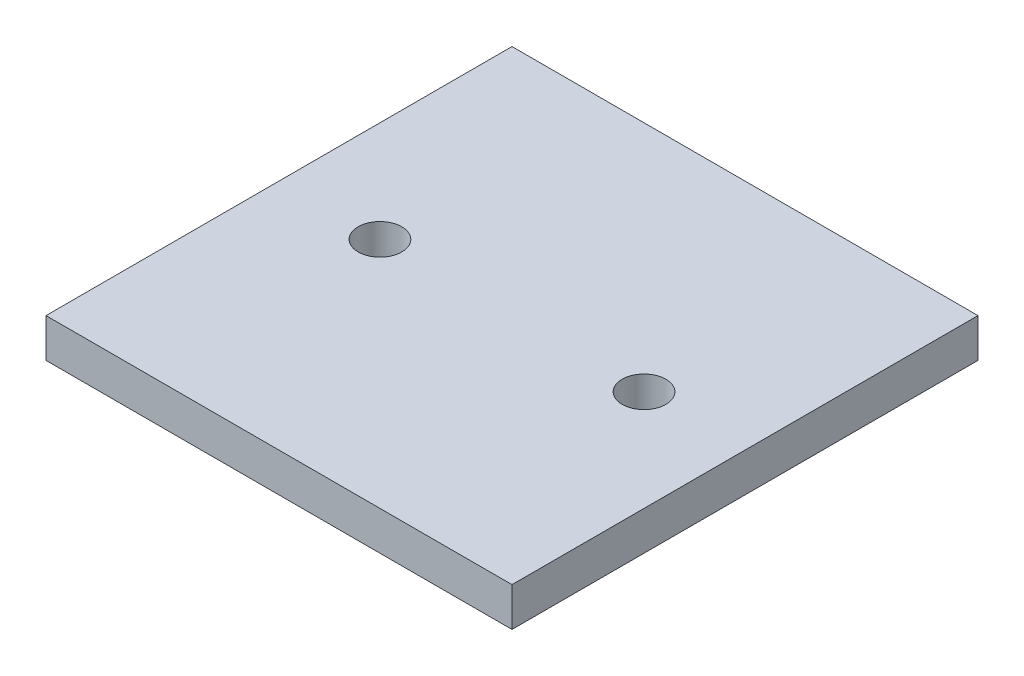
ISO-10303-21;
HEADER;
FILE_DESCRIPTION(('STEP AP214'),'2;1');
FILE_NAME('part.step','',(''),(''),'','','');
FILE_SCHEMA(('AUTOMOTIVE_DESIGN { 1 0 10303 214 1 1 1 1 }'));
ENDSEC;
DATA;
#1=APPLICATION_CONTEXT('core data for automotive mechanical design processes');
#2=APPLICATION_PROTOCOL_DEFINITION('international standard','automotive_design',2000,#1);
#3=PRODUCT_CONTEXT('',#1,'mechanical');
#4=PRODUCT('Part','Part','',(#3));
#5=PRODUCT_RELATED_PRODUCT_CATEGORY('part','',(#4));
#6=PRODUCT_DEFINITION_FORMATION('','',#4);
#7=PRODUCT_DEFINITION_CONTEXT('part definition',#1,'design');
#8=PRODUCT_DEFINITION('design','',#6,#7);
#9=PRODUCT_DEFINITION_SHAPE('','',#8);
#10=(LENGTH_UNIT() NAMED_UNIT(*) SI_UNIT(.MILLI.,.METRE.));
#11=(NAMED_UNIT(*) PLANE_ANGLE_UNIT() SI_UNIT($,.RADIAN.));
#12=(NAMED_UNIT(*) SI_UNIT($,.STERADIAN.) SOLID_ANGLE_UNIT());
#13=UNCERTAINTY_MEASURE_WITH_UNIT(LENGTH_MEASURE(1.E-05),#10,'distance_accuracy_value','');
#14=(GEOMETRIC_REPRESENTATION_CONTEXT(3) GLOBAL_UNCERTAINTY_ASSIGNED_CONTEXT((#13)) GLOBAL_UNIT_ASSIGNED_CONTEXT((#10,
#11,#12)) REPRESENTATION_CONTEXT('',''));
#15=CARTESIAN_POINT('',(0.,0.,0.));
#16=DIRECTION('',(0.,0.,1.));
#17=DIRECTION('',(1.,0.,0.));
#18=AXIS2_PLACEMENT_3D('',#15,#16,#17);
#19=CARTESIAN_POINT('',(-76.2,12.7,-76.2));
#20=DIRECTION('',(1.,0.,0.));
#21=DIRECTION('',(0.,0.,-1.));
#22=AXIS2_PLACEMENT_3D('',#19,#20,#21);
#23=PLANE('',#22);
#24=DIRECTION('',(0.,0.,1.));
#25=VECTOR('',#24,1.);
#26=CARTESIAN_POINT('',(-76.2,0.,-76.2));
#27=LINE('',#26,#25);
#28=CARTESIAN_POINT('',(-76.2,0.,-76.2));
#29=VERTEX_POINT('',#28);
#30=CARTESIAN_POINT('',(-76.2,0.,76.2));
#31=VERTEX_POINT('',#30);
#32=EDGE_CURVE('E96',#29,#31,#27,.T.);
#33=ORIENTED_EDGE('',*,*,#32,.T.);
#34=DIRECTION('',(0.,-1.,0.));
#35=VECTOR('',#34,1.);
#36=CARTESIAN_POINT('',(-76.2,12.7,76.2));
#37=LINE('',#36,#35);
#38=CARTESIAN_POINT('',(-76.2,12.7,76.2));
#39=VERTEX_POINT('',#38);
#40=EDGE_CURVE('E11',#39,#31,#37,.T.);
#41=ORIENTED_EDGE('',*,*,#40,.F.);
#42=DIRECTION('',(0.,0.,1.));
#43=VECTOR('',#42,1.);
#44=CARTESIAN_POINT('',(-76.2,12.7,-76.2));
#45=LINE('',#44,#43);
#46=CARTESIAN_POINT('',(-76.2,12.7,-76.2));
#47=VERTEX_POINT('',#46);
#48=EDGE_CURVE('E84',#47,#39,#45,.T.);
#49=ORIENTED_EDGE('',*,*,#48,.F.);
#50=DIRECTION('',(0.,-1.,0.));
#51=VECTOR('',#50,1.);
#52=CARTESIAN_POINT('',(-76.2,12.7,-76.2));
#53=LINE('',#52,#51);
#54=EDGE_CURVE('E92',#47,#29,#53,.T.);
#55=ORIENTED_EDGE('',*,*,#54,.T.);
#56=EDGE_LOOP('',(#33,#41,#49,#55));
#57=FACE_BOUND('',#56,.T.);
#58=ADVANCED_FACE('F33',(#57),#23,.F.);
#59=CARTESIAN_POINT('',(-76.2,12.7,76.2));
#60=DIRECTION('',(0.,0.,-1.));
#61=DIRECTION('',(-1.,0.,0.));
#62=AXIS2_PLACEMENT_3D('',#59,#60,#61);
#63=PLANE('',#62);
#64=DIRECTION('',(1.,0.,0.));
#65=VECTOR('',#64,1.);
#66=CARTESIAN_POINT('',(-76.2,0.,76.2));
#67=LINE('',#66,#65);
#68=CARTESIAN_POINT('',(76.2,0.,76.2));
#69=VERTEX_POINT('',#68);
#70=EDGE_CURVE('E88',#31,#69,#67,.T.);
#71=ORIENTED_EDGE('',*,*,#70,.T.);
#72=DIRECTION('',(0.,-1.,0.));
#73=VECTOR('',#72,1.);
#74=CARTESIAN_POINT('',(76.2,12.7,76.2));
#75=LINE('',#74,#73);
#76=CARTESIAN_POINT('',(76.2,12.7,76.2));
#77=VERTEX_POINT('',#76);
#78=EDGE_CURVE('E41',#77,#69,#75,.T.);
#79=ORIENTED_EDGE('',*,*,#78,.F.);
#80=DIRECTION('',(1.,0.,0.));
#81=VECTOR('',#80,1.);
#82=CARTESIAN_POINT('',(-76.2,12.7,76.2));
#83=LINE('',#82,#81);
#84=EDGE_CURVE('E79',#39,#77,#83,.T.);
#85=ORIENTED_EDGE('',*,*,#84,.F.);
#86=ORIENTED_EDGE('',*,*,#40,.T.);
#87=EDGE_LOOP('',(#71,#79,#85,#86));
#88=FACE_BOUND('',#87,.T.);
#89=ADVANCED_FACE('F87',(#88),#63,.F.);
#90=CARTESIAN_POINT('',(76.2,12.7,-76.2));
#91=DIRECTION('',(-1.,0.,0.));
#92=DIRECTION('',(0.,0.,1.));
#93=AXIS2_PLACEMENT_3D('',#90,#91,#92);
#94=PLANE('',#93);
#95=DIRECTION('',(0.,0.,-1.));
#96=VECTOR('',#95,1.);
#97=CARTESIAN_POINT('',(76.2,0.,-76.2));
#98=LINE('',#97,#96);
#99=CARTESIAN_POINT('',(76.2,0.,-76.2));
#100=VERTEX_POINT('',#99);
#101=EDGE_CURVE('E66',#69,#100,#98,.T.);
#102=ORIENTED_EDGE('',*,*,#101,.T.);
#103=DIRECTION('',(0.,-1.,0.));
#104=VECTOR('',#103,1.);
#105=CARTESIAN_POINT('',(76.2,12.7,-76.2));
#106=LINE('',#105,#104);
#107=CARTESIAN_POINT('',(76.2,12.7,-76.2));
#108=VERTEX_POINT('',#107);
#109=EDGE_CURVE('E89',#108,#100,#106,.T.);
#110=ORIENTED_EDGE('',*,*,#109,.F.);
#111=DIRECTION('',(0.,0.,-1.));
#112=VECTOR('',#111,1.);
#113=CARTESIAN_POINT('',(76.2,12.7,-76.2));
#114=LINE('',#113,#112);
#115=EDGE_CURVE('E82',#77,#108,#114,.T.);
#116=ORIENTED_EDGE('',*,*,#115,.F.);
#117=ORIENTED_EDGE('',*,*,#78,.T.);
#118=EDGE_LOOP('',(#102,#110,#116,#117));
#119=FACE_BOUND('',#118,.T.);
#120=ADVANCED_FACE('F90',(#119),#94,.F.);
#121=CARTESIAN_POINT('',(-76.2,12.7,-76.2));
#122=DIRECTION('',(0.,0.,1.));
#123=DIRECTION('',(1.,0.,0.));
#124=AXIS2_PLACEMENT_3D('',#121,#122,#123);
#125=PLANE('',#124);
#126=DIRECTION('',(-1.,0.,0.));
#127=VECTOR('',#126,1.);
#128=CARTESIAN_POINT('',(-76.2,0.,-76.2));
#129=LINE('',#128,#127);
#130=EDGE_CURVE('E72',#100,#29,#129,.T.);
#131=ORIENTED_EDGE('',*,*,#130,.T.);
#132=ORIENTED_EDGE('',*,*,#54,.F.);
#133=DIRECTION('',(-1.,0.,0.));
#134=VECTOR('',#133,1.);
#135=CARTESIAN_POINT('',(-76.2,12.7,-76.2));
#136=LINE('',#135,#134);
#137=EDGE_CURVE('E49',#108,#47,#136,.T.);
#138=ORIENTED_EDGE('',*,*,#137,.F.);
#139=ORIENTED_EDGE('',*,*,#109,.T.);
#140=EDGE_LOOP('',(#131,#132,#138,#139));
#141=FACE_BOUND('',#140,.T.);
#142=ADVANCED_FACE('F104',(#141),#125,.F.);
#143=CARTESIAN_POINT('',(0.,12.7,0.));
#144=DIRECTION('',(0.,1.,0.));
#145=DIRECTION('',(0.,0.,1.));
#146=AXIS2_PLACEMENT_3D('',#143,#144,#145);
#147=PLANE('',#146);
#148=CARTESIAN_POINT('',(-43.18,12.7,0.));
#149=DIRECTION('',(0.,1.,0.));
#150=DIRECTION('',(0.,0.,1.));
#151=AXIS2_PLACEMENT_3D('',#148,#149,#150);
#152=CIRCLE('',#151,7.14375);
#153=CARTESIAN_POINT('',(-43.18,12.7,7.14375));
#154=VERTEX_POINT('',#153);
#155=EDGE_CURVE('E99',#154,#154,#152,.F.);
#156=ORIENTED_EDGE('',*,*,#155,.T.);
#157=EDGE_LOOP('',(#156));
#158=FACE_BOUND('',#157,.T.);
#159=CARTESIAN_POINT('',(43.18,12.7,0.));
#160=DIRECTION('',(0.,1.,0.));
#161=DIRECTION('',(0.,0.,1.));
#162=AXIS2_PLACEMENT_3D('',#159,#160,#161);
#163=CIRCLE('',#162,7.14375);
#164=CARTESIAN_POINT('',(43.18,12.7,7.14375));
#165=VERTEX_POINT('',#164);
#166=EDGE_CURVE('E112',#165,#165,#163,.F.);
#167=ORIENTED_EDGE('',*,*,#166,.T.);
#168=EDGE_LOOP('',(#167));
#169=FACE_BOUND('',#168,.T.);
#170=ORIENTED_EDGE('',*,*,#48,.T.);
#171=ORIENTED_EDGE('',*,*,#84,.T.);
#172=ORIENTED_EDGE('',*,*,#115,.T.);
#173=ORIENTED_EDGE('',*,*,#137,.T.);
#174=EDGE_LOOP('',(#170,#171,#172,#173));
#175=FACE_BOUND('',#174,.T.);
#176=ADVANCED_FACE('F80',(#158,#169,#175),#147,.T.);
#177=CARTESIAN_POINT('',(0.,0.,0.));
#178=DIRECTION('',(0.,1.,0.));
#179=DIRECTION('',(0.,0.,1.));
#180=AXIS2_PLACEMENT_3D('',#177,#178,#179);
#181=PLANE('',#180);
#182=CARTESIAN_POINT('',(-43.18,0.,0.));
#183=DIRECTION('',(0.,1.,0.));
#184=DIRECTION('',(0.,0.,1.));
#185=AXIS2_PLACEMENT_3D('',#182,#183,#184);
#186=CIRCLE('',#185,7.14375);
#187=CARTESIAN_POINT('',(-43.18,0.,7.14375));
#188=VERTEX_POINT('',#187);
#189=EDGE_CURVE('E115',#188,#188,#186,.T.);
#190=ORIENTED_EDGE('',*,*,#189,.T.);
#191=EDGE_LOOP('',(#190));
#192=FACE_BOUND('',#191,.T.);
#193=CARTESIAN_POINT('',(43.18,0.,0.));
#194=DIRECTION('',(0.,1.,0.));
#195=DIRECTION('',(0.,0.,1.));
#196=AXIS2_PLACEMENT_3D('',#193,#194,#195);
#197=CIRCLE('',#196,7.14375);
#198=CARTESIAN_POINT('',(43.18,0.,7.14375));
#199=VERTEX_POINT('',#198);
#200=EDGE_CURVE('E116',#199,#199,#197,.T.);
#201=ORIENTED_EDGE('',*,*,#200,.T.);
#202=EDGE_LOOP('',(#201));
#203=FACE_BOUND('',#202,.T.);
#204=ORIENTED_EDGE('',*,*,#32,.F.);
#205=ORIENTED_EDGE('',*,*,#130,.F.);
#206=ORIENTED_EDGE('',*,*,#101,.F.);
#207=ORIENTED_EDGE('',*,*,#70,.F.);
#208=EDGE_LOOP('',(#204,#205,#206,#207));
#209=FACE_BOUND('',#208,.T.);
#210=ADVANCED_FACE('F107',(#192,#203,#209),#181,.F.);
#211=CARTESIAN_POINT('',(43.18,25.4,0.));
#212=DIRECTION('',(0.,-1.,0.));
#213=DIRECTION('',(0.,0.,-1.));
#214=AXIS2_PLACEMENT_3D('',#211,#212,#213);
#215=CYLINDRICAL_SURFACE('',#214,7.14375);
#216=ORIENTED_EDGE('',*,*,#166,.F.);
#217=EDGE_LOOP('',(#216));
#218=FACE_BOUND('',#217,.T.);
#219=ORIENTED_EDGE('',*,*,#200,.F.);
#220=EDGE_LOOP('',(#219));
#221=FACE_BOUND('',#220,.T.);
#222=ADVANCED_FACE('F126',(#218,#221),#215,.F.);
#223=CARTESIAN_POINT('',(-43.18,25.4,0.));
#224=DIRECTION('',(0.,-1.,0.));
#225=DIRECTION('',(0.,0.,-1.));
#226=AXIS2_PLACEMENT_3D('',#223,#224,#225);
#227=CYLINDRICAL_SURFACE('',#226,7.14375);
#228=ORIENTED_EDGE('',*,*,#155,.F.);
#229=EDGE_LOOP('',(#228));
#230=FACE_BOUND('',#229,.T.);
#231=ORIENTED_EDGE('',*,*,#189,.F.);
#232=EDGE_LOOP('',(#231));
#233=FACE_BOUND('',#232,.T.);
#234=ADVANCED_FACE('F124',(#230,#233),#227,.F.);
#235=CLOSED_SHELL('',(#58,#89,#120,#142,#176,#210,#222,#234));
#236=MANIFOLD_SOLID_BREP('B2',#235);
#237=ADVANCED_BREP_SHAPE_REPRESENTATION('',(#18,#236),#14);
#238=SHAPE_DEFINITION_REPRESENTATION(#9,#237);
ENDSEC;
END-ISO-10303-21;
